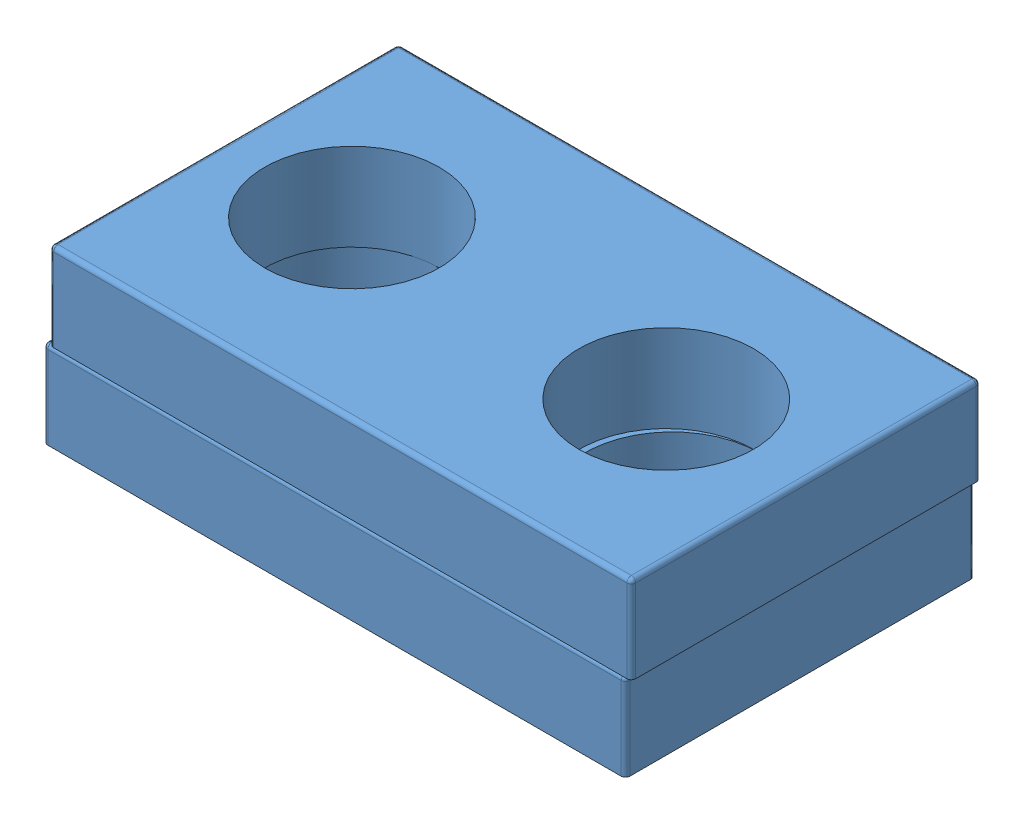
SolidWorks assembly Figure 12-26 and 12-27.SLDASM, configuration Default (file format 11000). Lengths in mm.
Overall size (101 30 60).
2 component instances, 1 part files, 2 mates.
Components (placement in the parent):
- Misaligned concentric mate-1: Misaligned concentric mate.SLDPRT [Default] at origin size (100 15 60)
- Misaligned concentric mate-2: Misaligned concentric mate.SLDPRT [Misaligned] at (1 15 0) size (100 15 60)
Mates (geometry in assembly coordinates):
- Concentric1: concentric: cylinder of Misaligned concentric mate-1 through (-28 15 0) axis (0 -1 0) radius 15; cylinder of Misaligned concentric mate-2 through (-27 30 0) axis (0 -1 0) radius 15
- Concentric2: concentric: cylinder of Misaligned concentric mate-1 through (28 15 0) axis (0 -1 0) radius 15; cylinder of Misaligned concentric mate-2 through (27 30 0) axis (0 -1 0) radius 15
